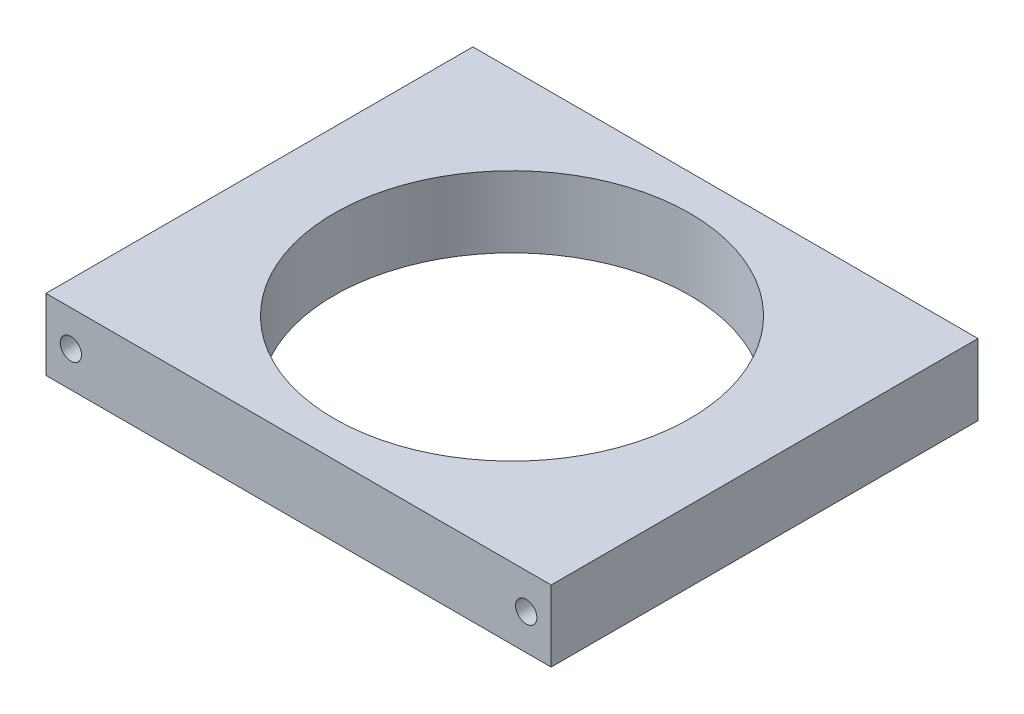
ISO-10303-21;
HEADER;
FILE_DESCRIPTION(('STEP AP214'),'2;1');
FILE_NAME('part.step','',(''),(''),'','','');
FILE_SCHEMA(('AUTOMOTIVE_DESIGN { 1 0 10303 214 1 1 1 1 }'));
ENDSEC;
DATA;
#1=APPLICATION_CONTEXT('core data for automotive mechanical design processes');
#2=APPLICATION_PROTOCOL_DEFINITION('international standard','automotive_design',2000,#1);
#3=PRODUCT_CONTEXT('',#1,'mechanical');
#4=PRODUCT('Part','Part','',(#3));
#5=PRODUCT_RELATED_PRODUCT_CATEGORY('part','',(#4));
#6=PRODUCT_DEFINITION_FORMATION('','',#4);
#7=PRODUCT_DEFINITION_CONTEXT('part definition',#1,'design');
#8=PRODUCT_DEFINITION('design','',#6,#7);
#9=PRODUCT_DEFINITION_SHAPE('','',#8);
#10=(LENGTH_UNIT() NAMED_UNIT(*) SI_UNIT(.MILLI.,.METRE.));
#11=(NAMED_UNIT(*) PLANE_ANGLE_UNIT() SI_UNIT($,.RADIAN.));
#12=(NAMED_UNIT(*) SI_UNIT($,.STERADIAN.) SOLID_ANGLE_UNIT());
#13=UNCERTAINTY_MEASURE_WITH_UNIT(LENGTH_MEASURE(1.E-05),#10,'distance_accuracy_value','');
#14=(GEOMETRIC_REPRESENTATION_CONTEXT(3) GLOBAL_UNCERTAINTY_ASSIGNED_CONTEXT((#13)) GLOBAL_UNIT_ASSIGNED_CONTEXT((#10,
#11,#12)) REPRESENTATION_CONTEXT('',''));
#15=CARTESIAN_POINT('',(0.,0.,0.));
#16=DIRECTION('',(0.,0.,1.));
#17=DIRECTION('',(1.,0.,0.));
#18=AXIS2_PLACEMENT_3D('',#15,#16,#17);
#19=CARTESIAN_POINT('',(35.5,10.,-30.));
#20=DIRECTION('',(-1.,0.,0.));
#21=DIRECTION('',(0.,0.,1.));
#22=AXIS2_PLACEMENT_3D('',#19,#20,#21);
#23=PLANE('',#22);
#24=DIRECTION('',(0.,0.,-1.));
#25=VECTOR('',#24,1.);
#26=CARTESIAN_POINT('',(35.5,0.,-30.));
#27=LINE('',#26,#25);
#28=CARTESIAN_POINT('',(35.5,0.,30.));
#29=VERTEX_POINT('',#28);
#30=CARTESIAN_POINT('',(35.5,0.,-30.));
#31=VERTEX_POINT('',#30);
#32=EDGE_CURVE('E97',#29,#31,#27,.T.);
#33=ORIENTED_EDGE('',*,*,#32,.T.);
#34=DIRECTION('',(0.,-1.,0.));
#35=VECTOR('',#34,1.);
#36=CARTESIAN_POINT('',(35.5,10.,-30.));
#37=LINE('',#36,#35);
#38=CARTESIAN_POINT('',(35.5,10.,-30.));
#39=VERTEX_POINT('',#38);
#40=EDGE_CURVE('E11',#39,#31,#37,.T.);
#41=ORIENTED_EDGE('',*,*,#40,.F.);
#42=DIRECTION('',(0.,0.,-1.));
#43=VECTOR('',#42,1.);
#44=CARTESIAN_POINT('',(35.5,10.,-30.));
#45=LINE('',#44,#43);
#46=CARTESIAN_POINT('',(35.5,10.,30.));
#47=VERTEX_POINT('',#46);
#48=EDGE_CURVE('E85',#47,#39,#45,.T.);
#49=ORIENTED_EDGE('',*,*,#48,.F.);
#50=DIRECTION('',(0.,-1.,0.));
#51=VECTOR('',#50,1.);
#52=CARTESIAN_POINT('',(35.5,10.,30.));
#53=LINE('',#52,#51);
#54=EDGE_CURVE('E93',#47,#29,#53,.T.);
#55=ORIENTED_EDGE('',*,*,#54,.T.);
#56=EDGE_LOOP('',(#33,#41,#49,#55));
#57=FACE_BOUND('',#56,.T.);
#58=ADVANCED_FACE('F34',(#57),#23,.F.);
#59=CARTESIAN_POINT('',(-35.5,10.,-30.));
#60=DIRECTION('',(0.,0.,1.));
#61=DIRECTION('',(1.,0.,0.));
#62=AXIS2_PLACEMENT_3D('',#59,#60,#61);
#63=PLANE('',#62);
#64=CARTESIAN_POINT('',(32.,5.,-30.));
#65=DIRECTION('',(0.,0.,-1.));
#66=DIRECTION('',(-1.,0.,0.));
#67=AXIS2_PLACEMENT_3D('',#64,#65,#66);
#68=CIRCLE('',#67,1.5);
#69=CARTESIAN_POINT('',(30.5,5.,-30.));
#70=VERTEX_POINT('',#69);
#71=EDGE_CURVE('E123',#70,#70,#68,.T.);
#72=ORIENTED_EDGE('',*,*,#71,.F.);
#73=EDGE_LOOP('',(#72));
#74=FACE_BOUND('',#73,.T.);
#75=CARTESIAN_POINT('',(-32.,5.00000000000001,-30.));
#76=DIRECTION('',(0.,0.,-1.));
#77=DIRECTION('',(-1.,0.,0.));
#78=AXIS2_PLACEMENT_3D('',#75,#76,#77);
#79=CIRCLE('',#78,1.5);
#80=CARTESIAN_POINT('',(-33.5,5.00000000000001,-30.));
#81=VERTEX_POINT('',#80);
#82=EDGE_CURVE('E117',#81,#81,#79,.T.);
#83=ORIENTED_EDGE('',*,*,#82,.F.);
#84=EDGE_LOOP('',(#83));
#85=FACE_BOUND('',#84,.T.);
#86=DIRECTION('',(-1.,0.,0.));
#87=VECTOR('',#86,1.);
#88=CARTESIAN_POINT('',(-35.5,0.,-30.));
#89=LINE('',#88,#87);
#90=CARTESIAN_POINT('',(-35.5,0.,-30.));
#91=VERTEX_POINT('',#90);
#92=EDGE_CURVE('E89',#31,#91,#89,.T.);
#93=ORIENTED_EDGE('',*,*,#92,.T.);
#94=DIRECTION('',(0.,-1.,0.));
#95=VECTOR('',#94,1.);
#96=CARTESIAN_POINT('',(-35.5,10.,-30.));
#97=LINE('',#96,#95);
#98=CARTESIAN_POINT('',(-35.5,10.,-30.));
#99=VERTEX_POINT('',#98);
#100=EDGE_CURVE('E42',#99,#91,#97,.T.);
#101=ORIENTED_EDGE('',*,*,#100,.F.);
#102=DIRECTION('',(-1.,0.,0.));
#103=VECTOR('',#102,1.);
#104=CARTESIAN_POINT('',(-35.5,10.,-30.));
#105=LINE('',#104,#103);
#106=EDGE_CURVE('E80',#39,#99,#105,.T.);
#107=ORIENTED_EDGE('',*,*,#106,.F.);
#108=ORIENTED_EDGE('',*,*,#40,.T.);
#109=EDGE_LOOP('',(#93,#101,#107,#108));
#110=FACE_BOUND('',#109,.T.);
#111=ADVANCED_FACE('F88',(#74,#85,#110),#63,.F.);
#112=CARTESIAN_POINT('',(-35.5,10.,-30.));
#113=DIRECTION('',(1.,0.,0.));
#114=DIRECTION('',(0.,0.,-1.));
#115=AXIS2_PLACEMENT_3D('',#112,#113,#114);
#116=PLANE('',#115);
#117=DIRECTION('',(0.,0.,1.));
#118=VECTOR('',#117,1.);
#119=CARTESIAN_POINT('',(-35.5,0.,-30.));
#120=LINE('',#119,#118);
#121=CARTESIAN_POINT('',(-35.5,0.,30.));
#122=VERTEX_POINT('',#121);
#123=EDGE_CURVE('E67',#91,#122,#120,.T.);
#124=ORIENTED_EDGE('',*,*,#123,.T.);
#125=DIRECTION('',(0.,-1.,0.));
#126=VECTOR('',#125,1.);
#127=CARTESIAN_POINT('',(-35.5,10.,30.));
#128=LINE('',#127,#126);
#129=CARTESIAN_POINT('',(-35.5,10.,30.));
#130=VERTEX_POINT('',#129);
#131=EDGE_CURVE('E90',#130,#122,#128,.T.);
#132=ORIENTED_EDGE('',*,*,#131,.F.);
#133=DIRECTION('',(0.,0.,1.));
#134=VECTOR('',#133,1.);
#135=CARTESIAN_POINT('',(-35.5,10.,-30.));
#136=LINE('',#135,#134);
#137=EDGE_CURVE('E83',#99,#130,#136,.T.);
#138=ORIENTED_EDGE('',*,*,#137,.F.);
#139=ORIENTED_EDGE('',*,*,#100,.T.);
#140=EDGE_LOOP('',(#124,#132,#138,#139));
#141=FACE_BOUND('',#140,.T.);
#142=ADVANCED_FACE('F91',(#141),#116,.F.);
#143=CARTESIAN_POINT('',(-35.5,10.,30.));
#144=DIRECTION('',(0.,0.,-1.));
#145=DIRECTION('',(-1.,0.,0.));
#146=AXIS2_PLACEMENT_3D('',#143,#144,#145);
#147=PLANE('',#146);
#148=CARTESIAN_POINT('',(32.,5.,30.));
#149=DIRECTION('',(0.,0.,-1.));
#150=DIRECTION('',(-1.,0.,0.));
#151=AXIS2_PLACEMENT_3D('',#148,#149,#150);
#152=CIRCLE('',#151,1.5);
#153=CARTESIAN_POINT('',(30.5,5.,30.));
#154=VERTEX_POINT('',#153);
#155=EDGE_CURVE('E114',#154,#154,#152,.T.);
#156=ORIENTED_EDGE('',*,*,#155,.T.);
#157=EDGE_LOOP('',(#156));
#158=FACE_BOUND('',#157,.T.);
#159=CARTESIAN_POINT('',(-32.,5.00000000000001,30.));
#160=DIRECTION('',(0.,0.,-1.));
#161=DIRECTION('',(-1.,0.,0.));
#162=AXIS2_PLACEMENT_3D('',#159,#160,#161);
#163=CIRCLE('',#162,1.5);
#164=CARTESIAN_POINT('',(-33.5,5.00000000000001,30.));
#165=VERTEX_POINT('',#164);
#166=EDGE_CURVE('E120',#165,#165,#163,.T.);
#167=ORIENTED_EDGE('',*,*,#166,.T.);
#168=EDGE_LOOP('',(#167));
#169=FACE_BOUND('',#168,.T.);
#170=DIRECTION('',(1.,0.,0.));
#171=VECTOR('',#170,1.);
#172=CARTESIAN_POINT('',(-35.5,0.,30.));
#173=LINE('',#172,#171);
#174=EDGE_CURVE('E73',#122,#29,#173,.T.);
#175=ORIENTED_EDGE('',*,*,#174,.T.);
#176=ORIENTED_EDGE('',*,*,#54,.F.);
#177=DIRECTION('',(1.,0.,0.));
#178=VECTOR('',#177,1.);
#179=CARTESIAN_POINT('',(-35.5,10.,30.));
#180=LINE('',#179,#178);
#181=EDGE_CURVE('E50',#130,#47,#180,.T.);
#182=ORIENTED_EDGE('',*,*,#181,.F.);
#183=ORIENTED_EDGE('',*,*,#131,.T.);
#184=EDGE_LOOP('',(#175,#176,#182,#183));
#185=FACE_BOUND('',#184,.T.);
#186=ADVANCED_FACE('F105',(#158,#169,#185),#147,.F.);
#187=CARTESIAN_POINT('',(0.,10.,0.));
#188=DIRECTION('',(0.,1.,0.));
#189=DIRECTION('',(0.,0.,1.));
#190=AXIS2_PLACEMENT_3D('',#187,#188,#189);
#191=PLANE('',#190);
#192=CARTESIAN_POINT('',(0.,10.,0.));
#193=DIRECTION('',(0.,1.,0.));
#194=DIRECTION('',(0.,0.,1.));
#195=AXIS2_PLACEMENT_3D('',#192,#193,#194);
#196=CIRCLE('',#195,25.);
#197=CARTESIAN_POINT('',(0.,10.,25.));
#198=VERTEX_POINT('',#197);
#199=EDGE_CURVE('E111',#198,#198,#196,.T.);
#200=ORIENTED_EDGE('',*,*,#199,.F.);
#201=EDGE_LOOP('',(#200));
#202=FACE_BOUND('',#201,.T.);
#203=ORIENTED_EDGE('',*,*,#48,.T.);
#204=ORIENTED_EDGE('',*,*,#106,.T.);
#205=ORIENTED_EDGE('',*,*,#137,.T.);
#206=ORIENTED_EDGE('',*,*,#181,.T.);
#207=EDGE_LOOP('',(#203,#204,#205,#206));
#208=FACE_BOUND('',#207,.T.);
#209=ADVANCED_FACE('F81',(#202,#208),#191,.T.);
#210=CARTESIAN_POINT('',(0.,0.,0.));
#211=DIRECTION('',(0.,1.,0.));
#212=DIRECTION('',(0.,0.,1.));
#213=AXIS2_PLACEMENT_3D('',#210,#211,#212);
#214=PLANE('',#213);
#215=CARTESIAN_POINT('',(0.,0.,0.));
#216=DIRECTION('',(0.,1.,0.));
#217=DIRECTION('',(0.,0.,1.));
#218=AXIS2_PLACEMENT_3D('',#215,#216,#217);
#219=CIRCLE('',#218,25.);
#220=CARTESIAN_POINT('',(0.,0.,25.));
#221=VERTEX_POINT('',#220);
#222=EDGE_CURVE('E100',#221,#221,#219,.T.);
#223=ORIENTED_EDGE('',*,*,#222,.T.);
#224=EDGE_LOOP('',(#223));
#225=FACE_BOUND('',#224,.T.);
#226=ORIENTED_EDGE('',*,*,#32,.F.);
#227=ORIENTED_EDGE('',*,*,#174,.F.);
#228=ORIENTED_EDGE('',*,*,#123,.F.);
#229=ORIENTED_EDGE('',*,*,#92,.F.);
#230=EDGE_LOOP('',(#226,#227,#228,#229));
#231=FACE_BOUND('',#230,.T.);
#232=ADVANCED_FACE('F108',(#225,#231),#214,.F.);
#233=CARTESIAN_POINT('',(0.,0.,0.));
#234=DIRECTION('',(0.,1.,0.));
#235=DIRECTION('',(0.,0.,1.));
#236=AXIS2_PLACEMENT_3D('',#233,#234,#235);
#237=CYLINDRICAL_SURFACE('',#236,25.);
#238=ORIENTED_EDGE('',*,*,#222,.F.);
#239=EDGE_LOOP('',(#238));
#240=FACE_BOUND('',#239,.T.);
#241=ORIENTED_EDGE('',*,*,#199,.T.);
#242=EDGE_LOOP('',(#241));
#243=FACE_BOUND('',#242,.T.);
#244=ADVANCED_FACE('F143',(#240,#243),#237,.F.);
#245=CARTESIAN_POINT('',(-32.,5.00000000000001,30.));
#246=DIRECTION('',(0.,0.,-1.));
#247=DIRECTION('',(-1.,0.,0.));
#248=AXIS2_PLACEMENT_3D('',#245,#246,#247);
#249=CYLINDRICAL_SURFACE('',#248,1.5);
#250=ORIENTED_EDGE('',*,*,#166,.F.);
#251=EDGE_LOOP('',(#250));
#252=FACE_BOUND('',#251,.T.);
#253=ORIENTED_EDGE('',*,*,#82,.T.);
#254=EDGE_LOOP('',(#253));
#255=FACE_BOUND('',#254,.T.);
#256=ADVANCED_FACE('F134',(#252,#255),#249,.F.);
#257=CARTESIAN_POINT('',(32.,5.,30.));
#258=DIRECTION('',(0.,0.,-1.));
#259=DIRECTION('',(-1.,0.,0.));
#260=AXIS2_PLACEMENT_3D('',#257,#258,#259);
#261=CYLINDRICAL_SURFACE('',#260,1.5);
#262=ORIENTED_EDGE('',*,*,#155,.F.);
#263=EDGE_LOOP('',(#262));
#264=FACE_BOUND('',#263,.T.);
#265=ORIENTED_EDGE('',*,*,#71,.T.);
#266=EDGE_LOOP('',(#265));
#267=FACE_BOUND('',#266,.T.);
#268=ADVANCED_FACE('F131',(#264,#267),#261,.F.);
#269=CLOSED_SHELL('',(#58,#111,#142,#186,#209,#232,#244,#256,#268));
#270=MANIFOLD_SOLID_BREP('B2',#269);
#271=ADVANCED_BREP_SHAPE_REPRESENTATION('',(#18,#270),#14);
#272=SHAPE_DEFINITION_REPRESENTATION(#9,#271);
ENDSEC;
END-ISO-10303-21;
